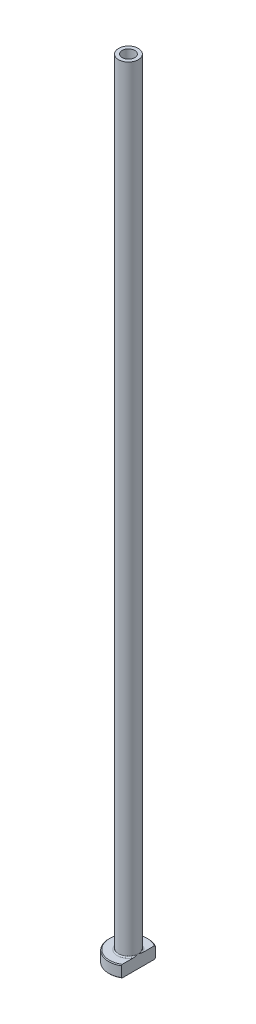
from build123d import *

# Parameters (mm, degrees)
FILLET1_R          = 0.3
CHAMFER1_SIZE      = 0.2
CUT_EXTRUDE1_DEPTH = 201.124960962
CHAMFER2_SIZE      = 0.5


with BuildPart() as part:
    # Sketch1 → Revolve1 (revolve)
    with BuildSketch(Plane.XY, mode=Mode.PRIVATE) as revolve1_sk:
        Polygon((-1.6, 200), (-2.5, 200), (-2.5, 3), (-5, 3), (-5, 0), (-1.85, 0), (-1.85, 143), (-1.6, 155), align=None)
    revolve(revolve1_sk.sketch.rotate(Axis((0, 92.187680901, 0), (0, -1, 0)), 270), axis=Axis((0, 92.187680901, 0), (0, -1, 0)))

    # Fillet1
    fillet1_edges = [part.edges().sort_by_distance(p)[0] for p in [
        (0, 3, -2.5),
    ]]
    fillet(fillet1_edges, radius=FILLET1_R)

    # Chamfer1
    chamfer1_edges = [part.edges().sort_by_distance(p)[0] for p in [
        (0, 0, -5),
        (0, 3, -5),
    ]]
    chamfer(chamfer1_edges, length=CHAMFER1_SIZE)

    # Sketch2 → Cut-Extrude1 (cut, through all)
    with BuildSketch(Plane.XZ):
        with BuildLine():
            Line((2.5, 4.330127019), (2.5, -4.330127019))
            ThreePointArc((2.5, -4.330127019), (5, 0), (2.5, 4.330127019))
        make_face()
    extrude(amount=-CUT_EXTRUDE1_DEPTH, mode=Mode.SUBTRACT)

    # Chamfer2
    chamfer2_edges = [part.edges().sort_by_distance(p)[0] for p in [
        (0, 0, -1.85),
    ]]
    chamfer(chamfer2_edges, length=CHAMFER2_SIZE)


solid = part.part
